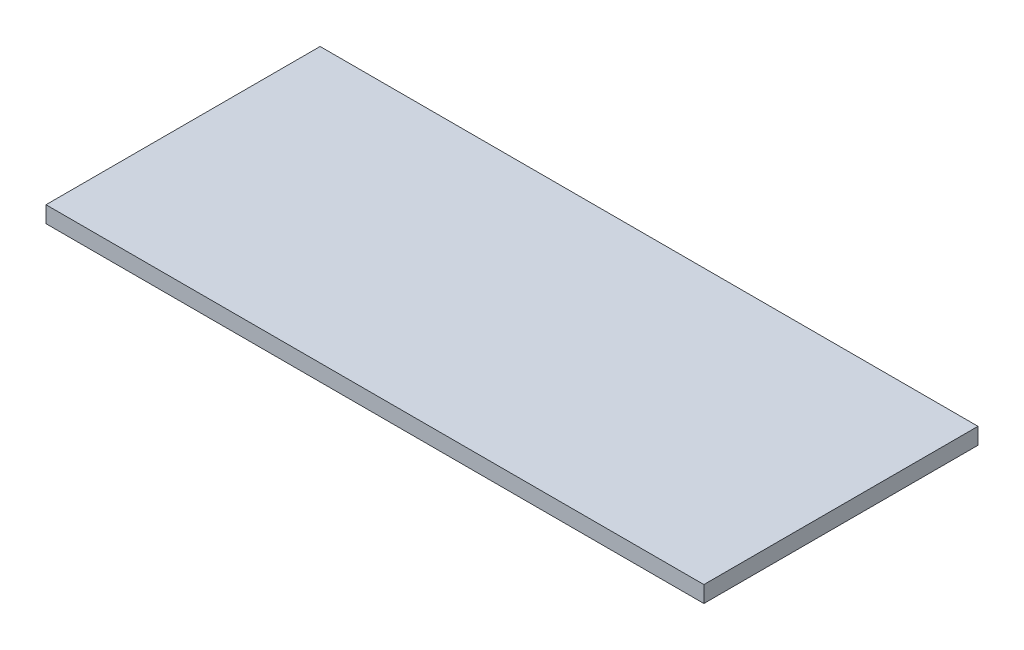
ISO-10303-21;
HEADER;
FILE_DESCRIPTION(('STEP AP214'),'2;1');
FILE_NAME('part.step','',(''),(''),'','','');
FILE_SCHEMA(('AUTOMOTIVE_DESIGN { 1 0 10303 214 1 1 1 1 }'));
ENDSEC;
DATA;
#1=APPLICATION_CONTEXT('core data for automotive mechanical design processes');
#2=APPLICATION_PROTOCOL_DEFINITION('international standard','automotive_design',2000,#1);
#3=PRODUCT_CONTEXT('',#1,'mechanical');
#4=PRODUCT('Part','Part','',(#3));
#5=PRODUCT_RELATED_PRODUCT_CATEGORY('part','',(#4));
#6=PRODUCT_DEFINITION_FORMATION('','',#4);
#7=PRODUCT_DEFINITION_CONTEXT('part definition',#1,'design');
#8=PRODUCT_DEFINITION('design','',#6,#7);
#9=PRODUCT_DEFINITION_SHAPE('','',#8);
#10=(LENGTH_UNIT() NAMED_UNIT(*) SI_UNIT(.MILLI.,.METRE.));
#11=(NAMED_UNIT(*) PLANE_ANGLE_UNIT() SI_UNIT($,.RADIAN.));
#12=(NAMED_UNIT(*) SI_UNIT($,.STERADIAN.) SOLID_ANGLE_UNIT());
#13=UNCERTAINTY_MEASURE_WITH_UNIT(LENGTH_MEASURE(1.E-05),#10,'distance_accuracy_value','');
#14=(GEOMETRIC_REPRESENTATION_CONTEXT(3) GLOBAL_UNCERTAINTY_ASSIGNED_CONTEXT((#13)) GLOBAL_UNIT_ASSIGNED_CONTEXT((#10,
#11,#12)) REPRESENTATION_CONTEXT('',''));
#15=CARTESIAN_POINT('',(0.,0.,0.));
#16=DIRECTION('',(0.,0.,1.));
#17=DIRECTION('',(1.,0.,0.));
#18=AXIS2_PLACEMENT_3D('',#15,#16,#17);
#19=CARTESIAN_POINT('',(60.,3.,-25.));
#20=DIRECTION('',(-1.,0.,0.));
#21=DIRECTION('',(0.,0.,1.));
#22=AXIS2_PLACEMENT_3D('',#19,#20,#21);
#23=PLANE('',#22);
#24=DIRECTION('',(0.,0.,-1.));
#25=VECTOR('',#24,1.);
#26=CARTESIAN_POINT('',(60.,0.,-25.));
#27=LINE('',#26,#25);
#28=CARTESIAN_POINT('',(60.,0.,25.));
#29=VERTEX_POINT('',#28);
#30=CARTESIAN_POINT('',(60.,0.,-25.));
#31=VERTEX_POINT('',#30);
#32=EDGE_CURVE('E98',#29,#31,#27,.T.);
#33=ORIENTED_EDGE('',*,*,#32,.T.);
#34=DIRECTION('',(0.,-1.,0.));
#35=VECTOR('',#34,1.);
#36=CARTESIAN_POINT('',(60.,3.,-25.));
#37=LINE('',#36,#35);
#38=CARTESIAN_POINT('',(60.,3.,-25.));
#39=VERTEX_POINT('',#38);
#40=EDGE_CURVE('E11',#39,#31,#37,.T.);
#41=ORIENTED_EDGE('',*,*,#40,.F.);
#42=DIRECTION('',(0.,0.,-1.));
#43=VECTOR('',#42,1.);
#44=CARTESIAN_POINT('',(60.,3.,-25.));
#45=LINE('',#44,#43);
#46=CARTESIAN_POINT('',(60.,3.,25.));
#47=VERTEX_POINT('',#46);
#48=EDGE_CURVE('E86',#47,#39,#45,.T.);
#49=ORIENTED_EDGE('',*,*,#48,.F.);
#50=DIRECTION('',(0.,-1.,0.));
#51=VECTOR('',#50,1.);
#52=CARTESIAN_POINT('',(60.,3.,25.));
#53=LINE('',#52,#51);
#54=EDGE_CURVE('E94',#47,#29,#53,.T.);
#55=ORIENTED_EDGE('',*,*,#54,.T.);
#56=EDGE_LOOP('',(#33,#41,#49,#55));
#57=FACE_BOUND('',#56,.T.);
#58=ADVANCED_FACE('F35',(#57),#23,.F.);
#59=CARTESIAN_POINT('',(-60.,3.,-25.));
#60=DIRECTION('',(0.,0.,1.));
#61=DIRECTION('',(1.,0.,0.));
#62=AXIS2_PLACEMENT_3D('',#59,#60,#61);
#63=PLANE('',#62);
#64=DIRECTION('',(-1.,0.,0.));
#65=VECTOR('',#64,1.);
#66=CARTESIAN_POINT('',(-60.,0.,-25.));
#67=LINE('',#66,#65);
#68=CARTESIAN_POINT('',(-60.,0.,-25.));
#69=VERTEX_POINT('',#68);
#70=EDGE_CURVE('E90',#31,#69,#67,.T.);
#71=ORIENTED_EDGE('',*,*,#70,.T.);
#72=DIRECTION('',(0.,-1.,0.));
#73=VECTOR('',#72,1.);
#74=CARTESIAN_POINT('',(-60.,3.,-25.));
#75=LINE('',#74,#73);
#76=CARTESIAN_POINT('',(-60.,3.,-25.));
#77=VERTEX_POINT('',#76);
#78=EDGE_CURVE('E43',#77,#69,#75,.T.);
#79=ORIENTED_EDGE('',*,*,#78,.F.);
#80=DIRECTION('',(-1.,0.,0.));
#81=VECTOR('',#80,1.);
#82=CARTESIAN_POINT('',(-60.,3.,-25.));
#83=LINE('',#82,#81);
#84=EDGE_CURVE('E81',#39,#77,#83,.T.);
#85=ORIENTED_EDGE('',*,*,#84,.F.);
#86=ORIENTED_EDGE('',*,*,#40,.T.);
#87=EDGE_LOOP('',(#71,#79,#85,#86));
#88=FACE_BOUND('',#87,.T.);
#89=ADVANCED_FACE('F89',(#88),#63,.F.);
#90=CARTESIAN_POINT('',(-60.,3.,-25.));
#91=DIRECTION('',(1.,0.,0.));
#92=DIRECTION('',(0.,0.,-1.));
#93=AXIS2_PLACEMENT_3D('',#90,#91,#92);
#94=PLANE('',#93);
#95=DIRECTION('',(0.,0.,1.));
#96=VECTOR('',#95,1.);
#97=CARTESIAN_POINT('',(-60.,0.,-25.));
#98=LINE('',#97,#96);
#99=CARTESIAN_POINT('',(-60.,0.,25.));
#100=VERTEX_POINT('',#99);
#101=EDGE_CURVE('E68',#69,#100,#98,.T.);
#102=ORIENTED_EDGE('',*,*,#101,.T.);
#103=DIRECTION('',(0.,-1.,0.));
#104=VECTOR('',#103,1.);
#105=CARTESIAN_POINT('',(-60.,3.,25.));
#106=LINE('',#105,#104);
#107=CARTESIAN_POINT('',(-60.,3.,25.));
#108=VERTEX_POINT('',#107);
#109=EDGE_CURVE('E91',#108,#100,#106,.T.);
#110=ORIENTED_EDGE('',*,*,#109,.F.);
#111=DIRECTION('',(0.,0.,1.));
#112=VECTOR('',#111,1.);
#113=CARTESIAN_POINT('',(-60.,3.,-25.));
#114=LINE('',#113,#112);
#115=EDGE_CURVE('E84',#77,#108,#114,.T.);
#116=ORIENTED_EDGE('',*,*,#115,.F.);
#117=ORIENTED_EDGE('',*,*,#78,.T.);
#118=EDGE_LOOP('',(#102,#110,#116,#117));
#119=FACE_BOUND('',#118,.T.);
#120=ADVANCED_FACE('F92',(#119),#94,.F.);
#121=CARTESIAN_POINT('',(-60.,3.,25.));
#122=DIRECTION('',(0.,0.,-1.));
#123=DIRECTION('',(-1.,0.,0.));
#124=AXIS2_PLACEMENT_3D('',#121,#122,#123);
#125=PLANE('',#124);
#126=DIRECTION('',(1.,0.,0.));
#127=VECTOR('',#126,1.);
#128=CARTESIAN_POINT('',(-60.,0.,25.));
#129=LINE('',#128,#127);
#130=EDGE_CURVE('E74',#100,#29,#129,.T.);
#131=ORIENTED_EDGE('',*,*,#130,.T.);
#132=ORIENTED_EDGE('',*,*,#54,.F.);
#133=DIRECTION('',(1.,0.,0.));
#134=VECTOR('',#133,1.);
#135=CARTESIAN_POINT('',(-60.,3.,25.));
#136=LINE('',#135,#134);
#137=EDGE_CURVE('E51',#108,#47,#136,.T.);
#138=ORIENTED_EDGE('',*,*,#137,.F.);
#139=ORIENTED_EDGE('',*,*,#109,.T.);
#140=EDGE_LOOP('',(#131,#132,#138,#139));
#141=FACE_BOUND('',#140,.T.);
#142=ADVANCED_FACE('F105',(#141),#125,.F.);
#143=CARTESIAN_POINT('',(0.,3.,0.));
#144=DIRECTION('',(0.,1.,0.));
#145=DIRECTION('',(0.,0.,1.));
#146=AXIS2_PLACEMENT_3D('',#143,#144,#145);
#147=PLANE('',#146);
#148=ORIENTED_EDGE('',*,*,#48,.T.);
#149=ORIENTED_EDGE('',*,*,#84,.T.);
#150=ORIENTED_EDGE('',*,*,#115,.T.);
#151=ORIENTED_EDGE('',*,*,#137,.T.);
#152=EDGE_LOOP('',(#148,#149,#150,#151));
#153=FACE_BOUND('',#152,.T.);
#154=ADVANCED_FACE('F82',(#153),#147,.T.);
#155=CARTESIAN_POINT('',(0.,0.,0.));
#156=DIRECTION('',(0.,1.,0.));
#157=DIRECTION('',(0.,0.,1.));
#158=AXIS2_PLACEMENT_3D('',#155,#156,#157);
#159=PLANE('',#158);
#160=ORIENTED_EDGE('',*,*,#32,.F.);
#161=ORIENTED_EDGE('',*,*,#130,.F.);
#162=ORIENTED_EDGE('',*,*,#101,.F.);
#163=ORIENTED_EDGE('',*,*,#70,.F.);
#164=EDGE_LOOP('',(#160,#161,#162,#163));
#165=FACE_BOUND('',#164,.T.);
#166=ADVANCED_FACE('F108',(#165),#159,.F.);
#167=CLOSED_SHELL('',(#58,#89,#120,#142,#154,#166));
#168=MANIFOLD_SOLID_BREP('B2',#167);
#169=ADVANCED_BREP_SHAPE_REPRESENTATION('',(#18,#168),#14);
#170=SHAPE_DEFINITION_REPRESENTATION(#9,#169);
ENDSEC;
END-ISO-10303-21;
